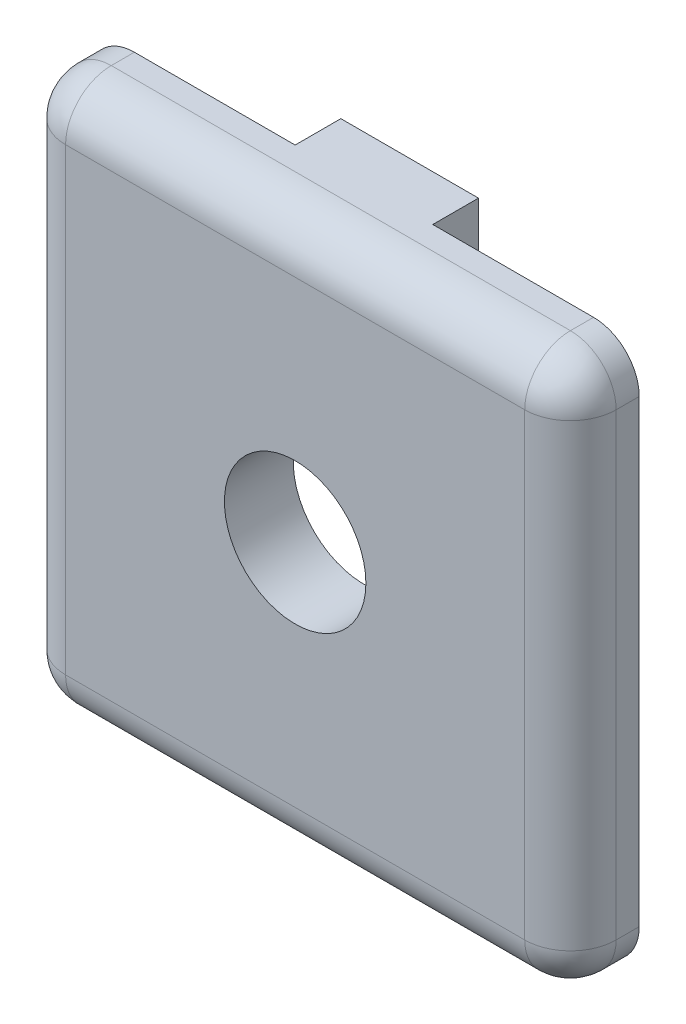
ISO-10303-21;
HEADER;
FILE_DESCRIPTION(('STEP AP214'),'2;1');
FILE_NAME('part.step','',(''),(''),'','','');
FILE_SCHEMA(('AUTOMOTIVE_DESIGN { 1 0 10303 214 1 1 1 1 }'));
ENDSEC;
DATA;
#1=APPLICATION_CONTEXT('core data for automotive mechanical design processes');
#2=APPLICATION_PROTOCOL_DEFINITION('international standard','automotive_design',2000,#1);
#3=PRODUCT_CONTEXT('',#1,'mechanical');
#4=PRODUCT('Part','Part','',(#3));
#5=PRODUCT_RELATED_PRODUCT_CATEGORY('part','',(#4));
#6=PRODUCT_DEFINITION_FORMATION('','',#4);
#7=PRODUCT_DEFINITION_CONTEXT('part definition',#1,'design');
#8=PRODUCT_DEFINITION('design','',#6,#7);
#9=PRODUCT_DEFINITION_SHAPE('','',#8);
#10=(LENGTH_UNIT() NAMED_UNIT(*) SI_UNIT(.MILLI.,.METRE.));
#11=(NAMED_UNIT(*) PLANE_ANGLE_UNIT() SI_UNIT($,.RADIAN.));
#12=(NAMED_UNIT(*) SI_UNIT($,.STERADIAN.) SOLID_ANGLE_UNIT());
#13=UNCERTAINTY_MEASURE_WITH_UNIT(LENGTH_MEASURE(1.E-05),#10,'distance_accuracy_value','');
#14=(GEOMETRIC_REPRESENTATION_CONTEXT(3) GLOBAL_UNCERTAINTY_ASSIGNED_CONTEXT((#13)) GLOBAL_UNIT_ASSIGNED_CONTEXT((#10,
#11,#12)) REPRESENTATION_CONTEXT('',''));
#15=CARTESIAN_POINT('',(0.,0.,0.));
#16=DIRECTION('',(0.,0.,1.));
#17=DIRECTION('',(1.,0.,0.));
#18=AXIS2_PLACEMENT_3D('',#15,#16,#17);
#19=CARTESIAN_POINT('',(-12.7,-12.7,0.));
#20=DIRECTION('',(0.,0.,1.));
#21=DIRECTION('',(1.,0.,0.));
#22=AXIS2_PLACEMENT_3D('',#19,#20,#21);
#23=PLANE('',#22);
#24=CARTESIAN_POINT('',(0.,0.,0.));
#25=DIRECTION('',(0.,0.,1.));
#26=DIRECTION('',(1.,0.,0.));
#27=AXIS2_PLACEMENT_3D('',#24,#25,#26);
#28=CIRCLE('',#27,3.2639);
#29=CARTESIAN_POINT('',(3.2639,0.,0.));
#30=VERTEX_POINT('',#29);
#31=EDGE_CURVE('E161',#30,#30,#28,.F.);
#32=ORIENTED_EDGE('',*,*,#31,.F.);
#33=EDGE_LOOP('',(#32));
#34=FACE_BOUND('',#33,.T.);
#35=DIRECTION('',(0.,-1.,0.));
#36=VECTOR('',#35,1.);
#37=CARTESIAN_POINT('',(3.175,12.7,0.));
#38=LINE('',#37,#36);
#39=CARTESIAN_POINT('',(3.17499999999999,12.7,0.));
#40=VERTEX_POINT('',#39);
#41=CARTESIAN_POINT('',(3.175,10.5918,0.));
#42=VERTEX_POINT('',#41);
#43=EDGE_CURVE('E157',#40,#42,#38,.T.);
#44=ORIENTED_EDGE('',*,*,#43,.F.);
#45=DIRECTION('',(-1.,0.,0.));
#46=VECTOR('',#45,1.);
#47=CARTESIAN_POINT('',(-12.7,12.7,0.));
#48=LINE('',#47,#46);
#49=CARTESIAN_POINT('',(10.5918,12.7,0.));
#50=VERTEX_POINT('',#49);
#51=EDGE_CURVE('E188',#50,#40,#48,.T.);
#52=ORIENTED_EDGE('',*,*,#51,.F.);
#53=CARTESIAN_POINT('',(10.5918,10.5918,0.));
#54=DIRECTION('',(0.,0.,1.));
#55=DIRECTION('',(1.,0.,0.));
#56=AXIS2_PLACEMENT_3D('',#53,#54,#55);
#57=CIRCLE('',#56,2.1082);
#58=CARTESIAN_POINT('',(12.7,10.5918,0.));
#59=VERTEX_POINT('',#58);
#60=EDGE_CURVE('E224',#50,#59,#57,.F.);
#61=ORIENTED_EDGE('',*,*,#60,.T.);
#62=DIRECTION('',(0.,1.,0.));
#63=VECTOR('',#62,1.);
#64=CARTESIAN_POINT('',(12.7,12.7,0.));
#65=LINE('',#64,#63);
#66=CARTESIAN_POINT('',(12.7,-10.5918,0.));
#67=VERTEX_POINT('',#66);
#68=EDGE_CURVE('E177',#67,#59,#65,.T.);
#69=ORIENTED_EDGE('',*,*,#68,.F.);
#70=CARTESIAN_POINT('',(10.5918,-10.5918,0.));
#71=DIRECTION('',(0.,0.,1.));
#72=DIRECTION('',(1.,0.,0.));
#73=AXIS2_PLACEMENT_3D('',#70,#71,#72);
#74=CIRCLE('',#73,2.1082);
#75=CARTESIAN_POINT('',(10.5918,-12.7,0.));
#76=VERTEX_POINT('',#75);
#77=EDGE_CURVE('E43',#67,#76,#74,.F.);
#78=ORIENTED_EDGE('',*,*,#77,.T.);
#79=DIRECTION('',(1.,0.,0.));
#80=VECTOR('',#79,1.);
#81=CARTESIAN_POINT('',(-12.7,-12.7,0.));
#82=LINE('',#81,#80);
#83=CARTESIAN_POINT('',(-10.5918,-12.7,0.));
#84=VERTEX_POINT('',#83);
#85=EDGE_CURVE('E173',#84,#76,#82,.T.);
#86=ORIENTED_EDGE('',*,*,#85,.F.);
#87=CARTESIAN_POINT('',(-10.5918,-10.5918,0.));
#88=DIRECTION('',(0.,0.,1.));
#89=DIRECTION('',(1.,0.,0.));
#90=AXIS2_PLACEMENT_3D('',#87,#88,#89);
#91=CIRCLE('',#90,2.1082);
#92=CARTESIAN_POINT('',(-12.7,-10.5918,0.));
#93=VERTEX_POINT('',#92);
#94=EDGE_CURVE('E11',#84,#93,#91,.F.);
#95=ORIENTED_EDGE('',*,*,#94,.T.);
#96=DIRECTION('',(0.,-1.,0.));
#97=VECTOR('',#96,1.);
#98=CARTESIAN_POINT('',(-12.7,12.7,0.));
#99=LINE('',#98,#97);
#100=CARTESIAN_POINT('',(-12.7,10.5918,0.));
#101=VERTEX_POINT('',#100);
#102=EDGE_CURVE('E170',#101,#93,#99,.T.);
#103=ORIENTED_EDGE('',*,*,#102,.F.);
#104=CARTESIAN_POINT('',(-10.5918,10.5918,0.));
#105=DIRECTION('',(0.,0.,1.));
#106=DIRECTION('',(1.,0.,0.));
#107=AXIS2_PLACEMENT_3D('',#104,#105,#106);
#108=CIRCLE('',#107,2.1082);
#109=CARTESIAN_POINT('',(-10.5918,12.7,0.));
#110=VERTEX_POINT('',#109);
#111=EDGE_CURVE('E226',#101,#110,#108,.F.);
#112=ORIENTED_EDGE('',*,*,#111,.T.);
#113=CARTESIAN_POINT('',(-3.17500000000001,12.7,0.));
#114=VERTEX_POINT('',#113);
#115=EDGE_CURVE('E57',#114,#110,#48,.T.);
#116=ORIENTED_EDGE('',*,*,#115,.F.);
#117=DIRECTION('',(0.,1.,0.));
#118=VECTOR('',#117,1.);
#119=CARTESIAN_POINT('',(-3.175,12.7,0.));
#120=LINE('',#119,#118);
#121=CARTESIAN_POINT('',(-3.175,10.5918,0.));
#122=VERTEX_POINT('',#121);
#123=EDGE_CURVE('E154',#122,#114,#120,.T.);
#124=ORIENTED_EDGE('',*,*,#123,.F.);
#125=DIRECTION('',(-1.,0.,0.));
#126=VECTOR('',#125,1.);
#127=CARTESIAN_POINT('',(3.175,10.5918,0.));
#128=LINE('',#127,#126);
#129=EDGE_CURVE('E51',#42,#122,#128,.T.);
#130=ORIENTED_EDGE('',*,*,#129,.F.);
#131=EDGE_LOOP('',(#44,#52,#61,#69,#78,#86,#95,#103,#112,#116,#124,#130));
#132=FACE_BOUND('',#131,.T.);
#133=ADVANCED_FACE('F34',(#34,#132),#23,.F.);
#134=CARTESIAN_POINT('',(-12.7,12.7,3.175));
#135=DIRECTION('',(1.,0.,0.));
#136=DIRECTION('',(0.,1.,0.));
#137=AXIS2_PLACEMENT_3D('',#134,#135,#136);
#138=PLANE('',#137);
#139=ORIENTED_EDGE('',*,*,#102,.T.);
#140=DIRECTION('',(0.,0.,-1.));
#141=VECTOR('',#140,1.);
#142=CARTESIAN_POINT('',(-12.7,-10.5918,3.175));
#143=LINE('',#142,#141);
#144=CARTESIAN_POINT('',(-12.7,-10.5918,1.0668));
#145=VERTEX_POINT('',#144);
#146=EDGE_CURVE('E228',#93,#145,#143,.F.);
#147=ORIENTED_EDGE('',*,*,#146,.T.);
#148=DIRECTION('',(0.,-1.,0.));
#149=VECTOR('',#148,1.);
#150=CARTESIAN_POINT('',(-12.7,12.7,1.0668));
#151=LINE('',#150,#149);
#152=CARTESIAN_POINT('',(-12.7,10.5918,1.0668));
#153=VERTEX_POINT('',#152);
#154=EDGE_CURVE('E230',#145,#153,#151,.F.);
#155=ORIENTED_EDGE('',*,*,#154,.T.);
#156=DIRECTION('',(0.,0.,-1.));
#157=VECTOR('',#156,1.);
#158=CARTESIAN_POINT('',(-12.7,10.5918,3.175));
#159=LINE('',#158,#157);
#160=EDGE_CURVE('E232',#153,#101,#159,.T.);
#161=ORIENTED_EDGE('',*,*,#160,.T.);
#162=EDGE_LOOP('',(#139,#147,#155,#161));
#163=FACE_BOUND('',#162,.T.);
#164=ADVANCED_FACE('F279',(#163),#138,.F.);
#165=CARTESIAN_POINT('',(-12.7,-12.7,3.175));
#166=DIRECTION('',(0.,1.,0.));
#167=DIRECTION('',(0.,0.,1.));
#168=AXIS2_PLACEMENT_3D('',#165,#166,#167);
#169=PLANE('',#168);
#170=DIRECTION('',(1.,0.,0.));
#171=VECTOR('',#170,1.);
#172=CARTESIAN_POINT('',(-12.7,-12.7,1.0668));
#173=LINE('',#172,#171);
#174=CARTESIAN_POINT('',(10.5918,-12.7,1.0668));
#175=VERTEX_POINT('',#174);
#176=CARTESIAN_POINT('',(-10.5918,-12.7,1.0668));
#177=VERTEX_POINT('',#176);
#178=EDGE_CURVE('E236',#175,#177,#173,.F.);
#179=ORIENTED_EDGE('',*,*,#178,.T.);
#180=DIRECTION('',(0.,0.,-1.));
#181=VECTOR('',#180,1.);
#182=CARTESIAN_POINT('',(-10.5918,-12.7,3.175));
#183=LINE('',#182,#181);
#184=EDGE_CURVE('E234',#177,#84,#183,.T.);
#185=ORIENTED_EDGE('',*,*,#184,.T.);
#186=ORIENTED_EDGE('',*,*,#85,.T.);
#187=DIRECTION('',(0.,0.,-1.));
#188=VECTOR('',#187,1.);
#189=CARTESIAN_POINT('',(10.5918,-12.7,3.175));
#190=LINE('',#189,#188);
#191=EDGE_CURVE('E238',#76,#175,#190,.F.);
#192=ORIENTED_EDGE('',*,*,#191,.T.);
#193=EDGE_LOOP('',(#179,#185,#186,#192));
#194=FACE_BOUND('',#193,.T.);
#195=ADVANCED_FACE('F294',(#194),#169,.F.);
#196=CARTESIAN_POINT('',(12.7,12.7,3.175));
#197=DIRECTION('',(-1.,0.,0.));
#198=DIRECTION('',(0.,-1.,0.));
#199=AXIS2_PLACEMENT_3D('',#196,#197,#198);
#200=PLANE('',#199);
#201=DIRECTION('',(0.,1.,0.));
#202=VECTOR('',#201,1.);
#203=CARTESIAN_POINT('',(12.7,-12.7,1.0668));
#204=LINE('',#203,#202);
#205=CARTESIAN_POINT('',(12.7,10.5918,1.0668));
#206=VERTEX_POINT('',#205);
#207=CARTESIAN_POINT('',(12.7,-10.5918,1.0668));
#208=VERTEX_POINT('',#207);
#209=EDGE_CURVE('E242',#206,#208,#204,.F.);
#210=ORIENTED_EDGE('',*,*,#209,.T.);
#211=DIRECTION('',(0.,0.,-1.));
#212=VECTOR('',#211,1.);
#213=CARTESIAN_POINT('',(12.7,-10.5918,3.175));
#214=LINE('',#213,#212);
#215=EDGE_CURVE('E240',#208,#67,#214,.T.);
#216=ORIENTED_EDGE('',*,*,#215,.T.);
#217=ORIENTED_EDGE('',*,*,#68,.T.);
#218=DIRECTION('',(0.,0.,-1.));
#219=VECTOR('',#218,1.);
#220=CARTESIAN_POINT('',(12.7,10.5918,3.175));
#221=LINE('',#220,#219);
#222=EDGE_CURVE('E244',#59,#206,#221,.F.);
#223=ORIENTED_EDGE('',*,*,#222,.T.);
#224=EDGE_LOOP('',(#210,#216,#217,#223));
#225=FACE_BOUND('',#224,.T.);
#226=ADVANCED_FACE('F341',(#225),#200,.F.);
#227=CARTESIAN_POINT('',(-12.7,12.7,3.175));
#228=DIRECTION('',(0.,-1.,0.));
#229=DIRECTION('',(1.,0.,0.));
#230=AXIS2_PLACEMENT_3D('',#227,#228,#229);
#231=PLANE('',#230);
#232=DIRECTION('',(-1.,0.,0.));
#233=VECTOR('',#232,1.);
#234=CARTESIAN_POINT('',(12.7,12.7,1.0668));
#235=LINE('',#234,#233);
#236=CARTESIAN_POINT('',(-10.5918,12.7,1.0668));
#237=VERTEX_POINT('',#236);
#238=CARTESIAN_POINT('',(10.5918,12.7,1.0668));
#239=VERTEX_POINT('',#238);
#240=EDGE_CURVE('E248',#237,#239,#235,.F.);
#241=ORIENTED_EDGE('',*,*,#240,.T.);
#242=DIRECTION('',(0.,0.,-1.));
#243=VECTOR('',#242,1.);
#244=CARTESIAN_POINT('',(10.5918,12.7,3.175));
#245=LINE('',#244,#243);
#246=EDGE_CURVE('E246',#239,#50,#245,.T.);
#247=ORIENTED_EDGE('',*,*,#246,.T.);
#248=ORIENTED_EDGE('',*,*,#51,.T.);
#249=DIRECTION('',(0.,0.,1.));
#250=VECTOR('',#249,1.);
#251=CARTESIAN_POINT('',(3.175,12.7,-2.1082));
#252=LINE('',#251,#250);
#253=CARTESIAN_POINT('',(3.175,12.7,-2.1082));
#254=VERTEX_POINT('',#253);
#255=EDGE_CURVE('E519',#254,#40,#252,.T.);
#256=ORIENTED_EDGE('',*,*,#255,.F.);
#257=DIRECTION('',(1.,0.,0.));
#258=VECTOR('',#257,1.);
#259=CARTESIAN_POINT('',(3.175,12.7,-2.1082));
#260=LINE('',#259,#258);
#261=CARTESIAN_POINT('',(-3.175,12.7,-2.1082));
#262=VERTEX_POINT('',#261);
#263=EDGE_CURVE('E150',#262,#254,#260,.T.);
#264=ORIENTED_EDGE('',*,*,#263,.F.);
#265=DIRECTION('',(0.,0.,1.));
#266=VECTOR('',#265,1.);
#267=CARTESIAN_POINT('',(-3.175,12.7,-2.1082));
#268=LINE('',#267,#266);
#269=EDGE_CURVE('E163',#262,#114,#268,.T.);
#270=ORIENTED_EDGE('',*,*,#269,.T.);
#271=ORIENTED_EDGE('',*,*,#115,.T.);
#272=DIRECTION('',(0.,0.,-1.));
#273=VECTOR('',#272,1.);
#274=CARTESIAN_POINT('',(-10.5918,12.7,3.175));
#275=LINE('',#274,#273);
#276=EDGE_CURVE('E251',#110,#237,#275,.F.);
#277=ORIENTED_EDGE('',*,*,#276,.T.);
#278=EDGE_LOOP('',(#241,#247,#248,#256,#264,#270,#271,#277));
#279=FACE_BOUND('',#278,.T.);
#280=ADVANCED_FACE('F338',(#279),#231,.F.);
#281=CARTESIAN_POINT('',(-12.7,-12.7,3.175));
#282=DIRECTION('',(0.,0.,1.));
#283=DIRECTION('',(1.,0.,0.));
#284=AXIS2_PLACEMENT_3D('',#281,#282,#283);
#285=PLANE('',#284);
#286=CARTESIAN_POINT('',(0.,0.,3.175));
#287=DIRECTION('',(0.,0.,1.));
#288=DIRECTION('',(1.,0.,0.));
#289=AXIS2_PLACEMENT_3D('',#286,#287,#288);
#290=CIRCLE('',#289,3.2639);
#291=CARTESIAN_POINT('',(3.2639,0.,3.175));
#292=VERTEX_POINT('',#291);
#293=EDGE_CURVE('E158',#292,#292,#290,.T.);
#294=ORIENTED_EDGE('',*,*,#293,.F.);
#295=EDGE_LOOP('',(#294));
#296=FACE_BOUND('',#295,.T.);
#297=DIRECTION('',(0.,1.,0.));
#298=VECTOR('',#297,1.);
#299=CARTESIAN_POINT('',(10.5918,12.7,3.175));
#300=LINE('',#299,#298);
#301=CARTESIAN_POINT('',(10.5918,-10.5918,3.175));
#302=VERTEX_POINT('',#301);
#303=CARTESIAN_POINT('',(10.5918,10.5918,3.175));
#304=VERTEX_POINT('',#303);
#305=EDGE_CURVE('E256',#302,#304,#300,.T.);
#306=ORIENTED_EDGE('',*,*,#305,.T.);
#307=DIRECTION('',(-1.,0.,0.));
#308=VECTOR('',#307,1.);
#309=CARTESIAN_POINT('',(-12.7,10.5918,3.175));
#310=LINE('',#309,#308);
#311=CARTESIAN_POINT('',(-10.5918,10.5918,3.175));
#312=VERTEX_POINT('',#311);
#313=EDGE_CURVE('E253',#304,#312,#310,.T.);
#314=ORIENTED_EDGE('',*,*,#313,.T.);
#315=DIRECTION('',(0.,-1.,0.));
#316=VECTOR('',#315,1.);
#317=CARTESIAN_POINT('',(-10.5918,-12.7,3.175));
#318=LINE('',#317,#316);
#319=CARTESIAN_POINT('',(-10.5918,-10.5918,3.175));
#320=VERTEX_POINT('',#319);
#321=EDGE_CURVE('E182',#312,#320,#318,.T.);
#322=ORIENTED_EDGE('',*,*,#321,.T.);
#323=DIRECTION('',(1.,0.,0.));
#324=VECTOR('',#323,1.);
#325=CARTESIAN_POINT('',(12.7,-10.5918,3.175));
#326=LINE('',#325,#324);
#327=EDGE_CURVE('E257',#320,#302,#326,.T.);
#328=ORIENTED_EDGE('',*,*,#327,.T.);
#329=EDGE_LOOP('',(#306,#314,#322,#328));
#330=FACE_BOUND('',#329,.T.);
#331=ADVANCED_FACE('F262',(#296,#330),#285,.T.);
#332=CARTESIAN_POINT('',(10.5918,-10.5918,3.175));
#333=DIRECTION('',(0.,0.,-1.));
#334=DIRECTION('',(-1.,0.,0.));
#335=AXIS2_PLACEMENT_3D('',#332,#333,#334);
#336=CYLINDRICAL_SURFACE('',#335,2.1082);
#337=ORIENTED_EDGE('',*,*,#77,.F.);
#338=ORIENTED_EDGE('',*,*,#215,.F.);
#339=CARTESIAN_POINT('',(10.5918,-10.5918,1.0668));
#340=DIRECTION('',(0.,0.,1.));
#341=DIRECTION('',(1.,0.,0.));
#342=AXIS2_PLACEMENT_3D('',#339,#340,#341);
#343=CIRCLE('',#342,2.1082);
#344=EDGE_CURVE('E174',#175,#208,#343,.T.);
#345=ORIENTED_EDGE('',*,*,#344,.F.);
#346=ORIENTED_EDGE('',*,*,#191,.F.);
#347=EDGE_LOOP('',(#337,#338,#345,#346));
#348=FACE_BOUND('',#347,.T.);
#349=ADVANCED_FACE('F36',(#348),#336,.T.);
#350=CARTESIAN_POINT('',(-12.7,-10.5918,1.0668));
#351=DIRECTION('',(-1.,0.,0.));
#352=DIRECTION('',(0.,0.,1.));
#353=AXIS2_PLACEMENT_3D('',#350,#351,#352);
#354=CYLINDRICAL_SURFACE('',#353,2.1082);
#355=CARTESIAN_POINT('',(-10.5918,-10.5918,1.0668));
#356=DIRECTION('',(-1.,0.,0.));
#357=DIRECTION('',(0.,0.,1.));
#358=AXIS2_PLACEMENT_3D('',#355,#356,#357);
#359=CIRCLE('',#358,2.1082);
#360=EDGE_CURVE('E196',#177,#320,#359,.T.);
#361=ORIENTED_EDGE('',*,*,#360,.F.);
#362=ORIENTED_EDGE('',*,*,#178,.F.);
#363=CARTESIAN_POINT('',(10.5918,-10.5918,1.0668));
#364=DIRECTION('',(1.,0.,0.));
#365=DIRECTION('',(0.,0.,-1.));
#366=AXIS2_PLACEMENT_3D('',#363,#364,#365);
#367=CIRCLE('',#366,2.1082);
#368=EDGE_CURVE('E193',#302,#175,#367,.T.);
#369=ORIENTED_EDGE('',*,*,#368,.F.);
#370=ORIENTED_EDGE('',*,*,#327,.F.);
#371=EDGE_LOOP('',(#361,#362,#369,#370));
#372=FACE_BOUND('',#371,.T.);
#373=ADVANCED_FACE('F268',(#372),#354,.T.);
#374=CARTESIAN_POINT('',(-10.5918,-10.5918,3.175));
#375=DIRECTION('',(0.,0.,-1.));
#376=DIRECTION('',(-1.,0.,0.));
#377=AXIS2_PLACEMENT_3D('',#374,#375,#376);
#378=CYLINDRICAL_SURFACE('',#377,2.1082);
#379=ORIENTED_EDGE('',*,*,#94,.F.);
#380=ORIENTED_EDGE('',*,*,#184,.F.);
#381=CARTESIAN_POINT('',(-10.5918,-10.5918,1.0668));
#382=DIRECTION('',(0.,0.,1.));
#383=DIRECTION('',(1.,0.,0.));
#384=AXIS2_PLACEMENT_3D('',#381,#382,#383);
#385=CIRCLE('',#384,2.1082);
#386=EDGE_CURVE('E199',#145,#177,#385,.T.);
#387=ORIENTED_EDGE('',*,*,#386,.F.);
#388=ORIENTED_EDGE('',*,*,#146,.F.);
#389=EDGE_LOOP('',(#379,#380,#387,#388));
#390=FACE_BOUND('',#389,.T.);
#391=ADVANCED_FACE('F291',(#390),#378,.T.);
#392=CARTESIAN_POINT('',(10.5918,-10.5918,1.0668));
#393=DIRECTION('',(0.,0.,1.));
#394=DIRECTION('',(1.,0.,0.));
#395=AXIS2_PLACEMENT_3D('',#392,#393,#394);
#396=SPHERICAL_SURFACE('',#395,2.1082);
#397=ORIENTED_EDGE('',*,*,#368,.T.);
#398=ORIENTED_EDGE('',*,*,#344,.T.);
#399=CARTESIAN_POINT('',(10.5918,-10.5918,1.0668));
#400=DIRECTION('',(0.,-1.,0.));
#401=DIRECTION('',(0.,0.,-1.));
#402=AXIS2_PLACEMENT_3D('',#399,#400,#401);
#403=CIRCLE('',#402,2.1082);
#404=EDGE_CURVE('E202',#302,#208,#403,.F.);
#405=ORIENTED_EDGE('',*,*,#404,.F.);
#406=EDGE_LOOP('',(#397,#398,#405));
#407=FACE_BOUND('',#406,.T.);
#408=ADVANCED_FACE('F302',(#407),#396,.T.);
#409=CARTESIAN_POINT('',(-10.5918,-10.5918,1.0668));
#410=DIRECTION('',(0.,0.,1.));
#411=DIRECTION('',(1.,0.,0.));
#412=AXIS2_PLACEMENT_3D('',#409,#410,#411);
#413=SPHERICAL_SURFACE('',#412,2.1082);
#414=ORIENTED_EDGE('',*,*,#386,.T.);
#415=ORIENTED_EDGE('',*,*,#360,.T.);
#416=CARTESIAN_POINT('',(-10.5918,-10.5918,1.0668));
#417=DIRECTION('',(0.,-1.,0.));
#418=DIRECTION('',(0.,0.,-1.));
#419=AXIS2_PLACEMENT_3D('',#416,#417,#418);
#420=CIRCLE('',#419,2.1082);
#421=EDGE_CURVE('E205',#145,#320,#420,.F.);
#422=ORIENTED_EDGE('',*,*,#421,.F.);
#423=EDGE_LOOP('',(#414,#415,#422));
#424=FACE_BOUND('',#423,.T.);
#425=ADVANCED_FACE('F273',(#424),#413,.T.);
#426=CARTESIAN_POINT('',(10.5918,10.5918,3.175));
#427=DIRECTION('',(0.,0.,-1.));
#428=DIRECTION('',(-1.,0.,0.));
#429=AXIS2_PLACEMENT_3D('',#426,#427,#428);
#430=CYLINDRICAL_SURFACE('',#429,2.1082);
#431=ORIENTED_EDGE('',*,*,#60,.F.);
#432=ORIENTED_EDGE('',*,*,#246,.F.);
#433=CARTESIAN_POINT('',(10.5918,10.5918,1.0668));
#434=DIRECTION('',(0.,0.,1.));
#435=DIRECTION('',(1.,0.,0.));
#436=AXIS2_PLACEMENT_3D('',#433,#434,#435);
#437=CIRCLE('',#436,2.1082);
#438=EDGE_CURVE('E208',#206,#239,#437,.T.);
#439=ORIENTED_EDGE('',*,*,#438,.F.);
#440=ORIENTED_EDGE('',*,*,#222,.F.);
#441=EDGE_LOOP('',(#431,#432,#439,#440));
#442=FACE_BOUND('',#441,.T.);
#443=ADVANCED_FACE('F396',(#442),#430,.T.);
#444=CARTESIAN_POINT('',(10.5918,-12.7,1.0668));
#445=DIRECTION('',(0.,-1.,0.));
#446=DIRECTION('',(1.,0.,0.));
#447=AXIS2_PLACEMENT_3D('',#444,#445,#446);
#448=CYLINDRICAL_SURFACE('',#447,2.1082);
#449=ORIENTED_EDGE('',*,*,#404,.T.);
#450=ORIENTED_EDGE('',*,*,#209,.F.);
#451=CARTESIAN_POINT('',(10.5918,10.5918,1.0668));
#452=DIRECTION('',(0.,1.,0.));
#453=DIRECTION('',(-1.,0.,0.));
#454=AXIS2_PLACEMENT_3D('',#451,#452,#453);
#455=CIRCLE('',#454,2.1082);
#456=EDGE_CURVE('E211',#304,#206,#455,.T.);
#457=ORIENTED_EDGE('',*,*,#456,.F.);
#458=ORIENTED_EDGE('',*,*,#305,.F.);
#459=EDGE_LOOP('',(#449,#450,#457,#458));
#460=FACE_BOUND('',#459,.T.);
#461=ADVANCED_FACE('F307',(#460),#448,.T.);
#462=CARTESIAN_POINT('',(-10.5918,-12.7,1.0668));
#463=DIRECTION('',(0.,1.,0.));
#464=DIRECTION('',(-1.,0.,0.));
#465=AXIS2_PLACEMENT_3D('',#462,#463,#464);
#466=CYLINDRICAL_SURFACE('',#465,2.1082);
#467=ORIENTED_EDGE('',*,*,#421,.T.);
#468=ORIENTED_EDGE('',*,*,#321,.F.);
#469=CARTESIAN_POINT('',(-10.5918,10.5918,1.0668));
#470=DIRECTION('',(0.,1.,0.));
#471=DIRECTION('',(0.,0.,1.));
#472=AXIS2_PLACEMENT_3D('',#469,#470,#471);
#473=CIRCLE('',#472,2.1082);
#474=EDGE_CURVE('E214',#153,#312,#473,.T.);
#475=ORIENTED_EDGE('',*,*,#474,.F.);
#476=ORIENTED_EDGE('',*,*,#154,.F.);
#477=EDGE_LOOP('',(#467,#468,#475,#476));
#478=FACE_BOUND('',#477,.T.);
#479=ADVANCED_FACE('F276',(#478),#466,.T.);
#480=CARTESIAN_POINT('',(-10.5918,10.5918,3.175));
#481=DIRECTION('',(0.,0.,-1.));
#482=DIRECTION('',(-1.,0.,0.));
#483=AXIS2_PLACEMENT_3D('',#480,#481,#482);
#484=CYLINDRICAL_SURFACE('',#483,2.1082);
#485=ORIENTED_EDGE('',*,*,#111,.F.);
#486=ORIENTED_EDGE('',*,*,#160,.F.);
#487=CARTESIAN_POINT('',(-10.5918,10.5918,1.0668));
#488=DIRECTION('',(0.,0.,1.));
#489=DIRECTION('',(1.,0.,0.));
#490=AXIS2_PLACEMENT_3D('',#487,#488,#489);
#491=CIRCLE('',#490,2.1082);
#492=EDGE_CURVE('E217',#237,#153,#491,.T.);
#493=ORIENTED_EDGE('',*,*,#492,.F.);
#494=ORIENTED_EDGE('',*,*,#276,.F.);
#495=EDGE_LOOP('',(#485,#486,#493,#494));
#496=FACE_BOUND('',#495,.T.);
#497=ADVANCED_FACE('F285',(#496),#484,.T.);
#498=CARTESIAN_POINT('',(10.5918,10.5918,1.0668));
#499=DIRECTION('',(0.,0.,1.));
#500=DIRECTION('',(1.,0.,0.));
#501=AXIS2_PLACEMENT_3D('',#498,#499,#500);
#502=SPHERICAL_SURFACE('',#501,2.1082);
#503=ORIENTED_EDGE('',*,*,#456,.T.);
#504=ORIENTED_EDGE('',*,*,#438,.T.);
#505=CARTESIAN_POINT('',(10.5918,10.5918,1.0668));
#506=DIRECTION('',(1.,0.,0.));
#507=DIRECTION('',(0.,0.,-1.));
#508=AXIS2_PLACEMENT_3D('',#505,#506,#507);
#509=CIRCLE('',#508,2.1082);
#510=EDGE_CURVE('E220',#304,#239,#509,.F.);
#511=ORIENTED_EDGE('',*,*,#510,.F.);
#512=EDGE_LOOP('',(#503,#504,#511));
#513=FACE_BOUND('',#512,.T.);
#514=ADVANCED_FACE('F311',(#513),#502,.T.);
#515=CARTESIAN_POINT('',(-10.5918,10.5918,1.0668));
#516=DIRECTION('',(0.,0.,1.));
#517=DIRECTION('',(1.,0.,0.));
#518=AXIS2_PLACEMENT_3D('',#515,#516,#517);
#519=SPHERICAL_SURFACE('',#518,2.1082);
#520=ORIENTED_EDGE('',*,*,#492,.T.);
#521=ORIENTED_EDGE('',*,*,#474,.T.);
#522=CARTESIAN_POINT('',(-10.5918,10.5918,1.0668));
#523=DIRECTION('',(-1.,0.,0.));
#524=DIRECTION('',(0.,0.,1.));
#525=AXIS2_PLACEMENT_3D('',#522,#523,#524);
#526=CIRCLE('',#525,2.1082);
#527=EDGE_CURVE('E169',#237,#312,#526,.F.);
#528=ORIENTED_EDGE('',*,*,#527,.F.);
#529=EDGE_LOOP('',(#520,#521,#528));
#530=FACE_BOUND('',#529,.T.);
#531=ADVANCED_FACE('F317',(#530),#519,.T.);
#532=CARTESIAN_POINT('',(-12.7,10.5918,1.0668));
#533=DIRECTION('',(1.,0.,0.));
#534=DIRECTION('',(0.,1.,0.));
#535=AXIS2_PLACEMENT_3D('',#532,#533,#534);
#536=CYLINDRICAL_SURFACE('',#535,2.1082);
#537=ORIENTED_EDGE('',*,*,#510,.T.);
#538=ORIENTED_EDGE('',*,*,#240,.F.);
#539=ORIENTED_EDGE('',*,*,#527,.T.);
#540=ORIENTED_EDGE('',*,*,#313,.F.);
#541=EDGE_LOOP('',(#537,#538,#539,#540));
#542=FACE_BOUND('',#541,.T.);
#543=ADVANCED_FACE('F314',(#542),#536,.T.);
#544=CARTESIAN_POINT('',(0.,0.,-0.00100000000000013));
#545=DIRECTION('',(0.,0.,1.));
#546=DIRECTION('',(1.,0.,0.));
#547=AXIS2_PLACEMENT_3D('',#544,#545,#546);
#548=CYLINDRICAL_SURFACE('',#547,3.2639);
#549=ORIENTED_EDGE('',*,*,#293,.T.);
#550=EDGE_LOOP('',(#549));
#551=FACE_BOUND('',#550,.T.);
#552=ORIENTED_EDGE('',*,*,#31,.T.);
#553=EDGE_LOOP('',(#552));
#554=FACE_BOUND('',#553,.T.);
#555=ADVANCED_FACE('F324',(#551,#554),#548,.F.);
#556=CARTESIAN_POINT('',(3.175,12.7,-2.1082));
#557=DIRECTION('',(-1.,0.,0.));
#558=DIRECTION('',(0.,0.,1.));
#559=AXIS2_PLACEMENT_3D('',#556,#557,#558);
#560=PLANE('',#559);
#561=ORIENTED_EDGE('',*,*,#43,.T.);
#562=DIRECTION('',(0.,0.,1.));
#563=VECTOR('',#562,1.);
#564=CARTESIAN_POINT('',(3.175,10.5918,-2.1082));
#565=LINE('',#564,#563);
#566=CARTESIAN_POINT('',(3.175,10.5918,-2.1082));
#567=VERTEX_POINT('',#566);
#568=EDGE_CURVE('E138',#567,#42,#565,.T.);
#569=ORIENTED_EDGE('',*,*,#568,.F.);
#570=DIRECTION('',(0.,-1.,0.));
#571=VECTOR('',#570,1.);
#572=CARTESIAN_POINT('',(3.175,12.7,-2.1082));
#573=LINE('',#572,#571);
#574=EDGE_CURVE('E145',#254,#567,#573,.T.);
#575=ORIENTED_EDGE('',*,*,#574,.F.);
#576=ORIENTED_EDGE('',*,*,#255,.T.);
#577=EDGE_LOOP('',(#561,#569,#575,#576));
#578=FACE_BOUND('',#577,.T.);
#579=ADVANCED_FACE('F156',(#578),#560,.F.);
#580=CARTESIAN_POINT('',(3.175,10.5918,-2.1082));
#581=DIRECTION('',(0.,1.,0.));
#582=DIRECTION('',(0.,0.,1.));
#583=AXIS2_PLACEMENT_3D('',#580,#581,#582);
#584=PLANE('',#583);
#585=ORIENTED_EDGE('',*,*,#129,.T.);
#586=DIRECTION('',(0.,0.,1.));
#587=VECTOR('',#586,1.);
#588=CARTESIAN_POINT('',(-3.175,10.5918,-2.1082));
#589=LINE('',#588,#587);
#590=CARTESIAN_POINT('',(-3.175,10.5918,-2.1082));
#591=VERTEX_POINT('',#590);
#592=EDGE_CURVE('E141',#591,#122,#589,.T.);
#593=ORIENTED_EDGE('',*,*,#592,.F.);
#594=DIRECTION('',(-1.,0.,0.));
#595=VECTOR('',#594,1.);
#596=CARTESIAN_POINT('',(3.175,10.5918,-2.1082));
#597=LINE('',#596,#595);
#598=EDGE_CURVE('E134',#567,#591,#597,.T.);
#599=ORIENTED_EDGE('',*,*,#598,.F.);
#600=ORIENTED_EDGE('',*,*,#568,.T.);
#601=EDGE_LOOP('',(#585,#593,#599,#600));
#602=FACE_BOUND('',#601,.T.);
#603=ADVANCED_FACE('F136',(#602),#584,.F.);
#604=CARTESIAN_POINT('',(-3.175,12.7,-2.1082));
#605=DIRECTION('',(1.,0.,0.));
#606=DIRECTION('',(0.,0.,-1.));
#607=AXIS2_PLACEMENT_3D('',#604,#605,#606);
#608=PLANE('',#607);
#609=ORIENTED_EDGE('',*,*,#123,.T.);
#610=ORIENTED_EDGE('',*,*,#269,.F.);
#611=DIRECTION('',(0.,1.,0.));
#612=VECTOR('',#611,1.);
#613=CARTESIAN_POINT('',(-3.175,12.7,-2.1082));
#614=LINE('',#613,#612);
#615=EDGE_CURVE('E144',#591,#262,#614,.T.);
#616=ORIENTED_EDGE('',*,*,#615,.F.);
#617=ORIENTED_EDGE('',*,*,#592,.T.);
#618=EDGE_LOOP('',(#609,#610,#616,#617));
#619=FACE_BOUND('',#618,.T.);
#620=ADVANCED_FACE('F453',(#619),#608,.F.);
#621=CARTESIAN_POINT('',(3.175,10.5918,-2.1082));
#622=DIRECTION('',(0.,0.,-1.));
#623=DIRECTION('',(-1.,0.,0.));
#624=AXIS2_PLACEMENT_3D('',#621,#622,#623);
#625=PLANE('',#624);
#626=ORIENTED_EDGE('',*,*,#574,.T.);
#627=ORIENTED_EDGE('',*,*,#598,.T.);
#628=ORIENTED_EDGE('',*,*,#615,.T.);
#629=ORIENTED_EDGE('',*,*,#263,.T.);
#630=EDGE_LOOP('',(#626,#627,#628,#629));
#631=FACE_BOUND('',#630,.T.);
#632=ADVANCED_FACE('F148',(#631),#625,.T.);
#633=CLOSED_SHELL('',(#133,#164,#195,#226,#280,#331,#349,#373,#391,#408,#425,#443,#461,#479,
#497,#514,#531,#543,#555,#579,#603,#620,#632));
#634=MANIFOLD_SOLID_BREP('B2',#633);
#635=ADVANCED_BREP_SHAPE_REPRESENTATION('',(#18,#634),#14);
#636=SHAPE_DEFINITION_REPRESENTATION(#9,#635);
ENDSEC;
END-ISO-10303-21;
